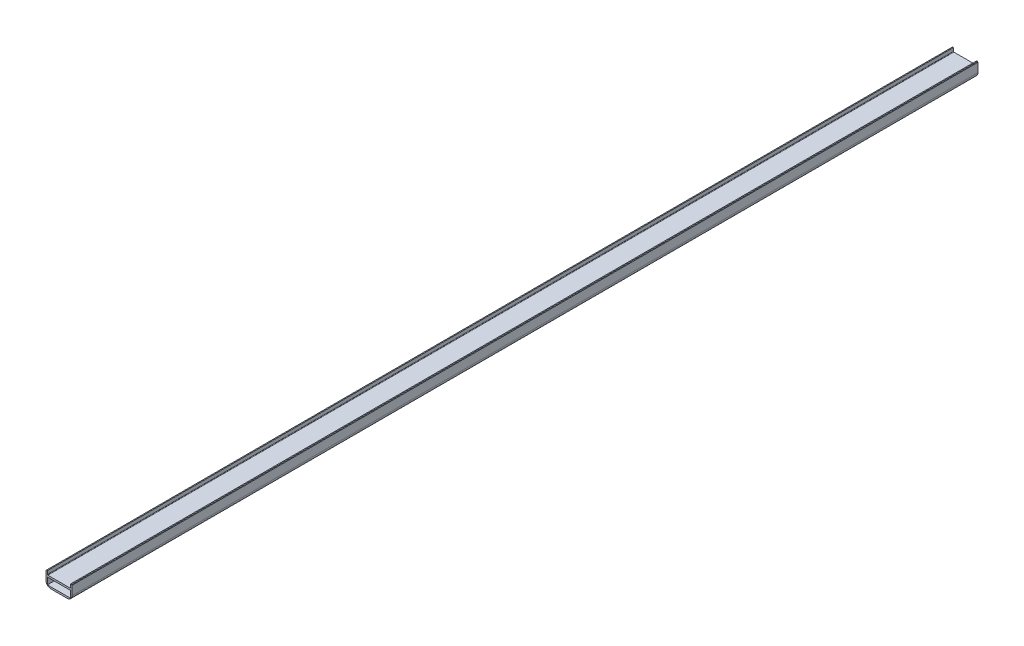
ISO-10303-21;
HEADER;
FILE_DESCRIPTION(('STEP AP214'),'2;1');
FILE_NAME('part.step','',(''),(''),'','','');
FILE_SCHEMA(('AUTOMOTIVE_DESIGN { 1 0 10303 214 1 1 1 1 }'));
ENDSEC;
DATA;
#1=APPLICATION_CONTEXT('core data for automotive mechanical design processes');
#2=APPLICATION_PROTOCOL_DEFINITION('international standard','automotive_design',2000,#1);
#3=PRODUCT_CONTEXT('',#1,'mechanical');
#4=PRODUCT('Part','Part','',(#3));
#5=PRODUCT_RELATED_PRODUCT_CATEGORY('part','',(#4));
#6=PRODUCT_DEFINITION_FORMATION('','',#4);
#7=PRODUCT_DEFINITION_CONTEXT('part definition',#1,'design');
#8=PRODUCT_DEFINITION('design','',#6,#7);
#9=PRODUCT_DEFINITION_SHAPE('','',#8);
#10=(LENGTH_UNIT() NAMED_UNIT(*) SI_UNIT(.MILLI.,.METRE.));
#11=(NAMED_UNIT(*) PLANE_ANGLE_UNIT() SI_UNIT($,.RADIAN.));
#12=(NAMED_UNIT(*) SI_UNIT($,.STERADIAN.) SOLID_ANGLE_UNIT());
#13=UNCERTAINTY_MEASURE_WITH_UNIT(LENGTH_MEASURE(1.E-05),#10,'distance_accuracy_value','');
#14=(GEOMETRIC_REPRESENTATION_CONTEXT(3) GLOBAL_UNCERTAINTY_ASSIGNED_CONTEXT((#13)) GLOBAL_UNIT_ASSIGNED_CONTEXT((#10,
#11,#12)) REPRESENTATION_CONTEXT('',''));
#15=CARTESIAN_POINT('',(0.,0.,0.));
#16=DIRECTION('',(0.,0.,1.));
#17=DIRECTION('',(1.,0.,0.));
#18=AXIS2_PLACEMENT_3D('',#15,#16,#17);
#19=CARTESIAN_POINT('',(-24.5,3.02774114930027,960.));
#20=DIRECTION('',(-1.,0.,0.));
#21=DIRECTION('',(0.,0.,1.));
#22=AXIS2_PLACEMENT_3D('',#19,#20,#21);
#23=PLANE('',#22);
#24=DIRECTION('',(0.,1.,0.));
#25=VECTOR('',#24,1.);
#26=CARTESIAN_POINT('',(-24.5,3.02774114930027,-960.));
#27=LINE('',#26,#25);
#28=CARTESIAN_POINT('',(-24.5,-3.97225885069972,-960.));
#29=VERTEX_POINT('',#28);
#30=CARTESIAN_POINT('',(-24.5,3.02774114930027,-960.));
#31=VERTEX_POINT('',#30);
#32=EDGE_CURVE('E184',#29,#31,#27,.T.);
#33=ORIENTED_EDGE('',*,*,#32,.T.);
#34=DIRECTION('',(0.,0.,-1.));
#35=VECTOR('',#34,1.);
#36=CARTESIAN_POINT('',(-24.5,3.02774114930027,960.));
#37=LINE('',#36,#35);
#38=CARTESIAN_POINT('',(-24.5,3.02774114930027,960.));
#39=VERTEX_POINT('',#38);
#40=EDGE_CURVE('E249',#39,#31,#37,.T.);
#41=ORIENTED_EDGE('',*,*,#40,.F.);
#42=DIRECTION('',(0.,1.,0.));
#43=VECTOR('',#42,1.);
#44=CARTESIAN_POINT('',(-24.5,3.02774114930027,960.));
#45=LINE('',#44,#43);
#46=CARTESIAN_POINT('',(-24.5,-3.97225885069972,960.));
#47=VERTEX_POINT('',#46);
#48=EDGE_CURVE('E187',#47,#39,#45,.T.);
#49=ORIENTED_EDGE('',*,*,#48,.F.);
#50=DIRECTION('',(0.,0.,-1.));
#51=VECTOR('',#50,1.);
#52=CARTESIAN_POINT('',(-24.5,-3.97225885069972,960.));
#53=LINE('',#52,#51);
#54=EDGE_CURVE('E212',#47,#29,#53,.T.);
#55=ORIENTED_EDGE('',*,*,#54,.T.);
#56=EDGE_LOOP('',(#33,#41,#49,#55));
#57=FACE_BOUND('',#56,.T.);
#58=ADVANCED_FACE('F34',(#57),#23,.F.);
#59=CARTESIAN_POINT('',(-24.5,3.02774114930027,960.));
#60=DIRECTION('',(0.,-1.,0.));
#61=DIRECTION('',(1.,0.,0.));
#62=AXIS2_PLACEMENT_3D('',#59,#60,#61);
#63=PLANE('',#62);
#64=DIRECTION('',(-1.,0.,0.));
#65=VECTOR('',#64,1.);
#66=CARTESIAN_POINT('',(-24.5,3.02774114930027,-960.));
#67=LINE('',#66,#65);
#68=CARTESIAN_POINT('',(-26.4999999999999,3.02774114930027,-960.));
#69=VERTEX_POINT('',#68);
#70=EDGE_CURVE('E215',#31,#69,#67,.T.);
#71=ORIENTED_EDGE('',*,*,#70,.T.);
#72=DIRECTION('',(0.,0.,1.));
#73=VECTOR('',#72,1.);
#74=CARTESIAN_POINT('',(-26.4999999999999,3.02774114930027,960.));
#75=LINE('',#74,#73);
#76=CARTESIAN_POINT('',(-26.4999999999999,3.02774114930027,960.));
#77=VERTEX_POINT('',#76);
#78=EDGE_CURVE('E288',#69,#77,#75,.T.);
#79=ORIENTED_EDGE('',*,*,#78,.T.);
#80=DIRECTION('',(-1.,0.,0.));
#81=VECTOR('',#80,1.);
#82=CARTESIAN_POINT('',(-24.5,3.02774114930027,960.));
#83=LINE('',#82,#81);
#84=EDGE_CURVE('E190',#39,#77,#83,.T.);
#85=ORIENTED_EDGE('',*,*,#84,.F.);
#86=ORIENTED_EDGE('',*,*,#40,.T.);
#87=EDGE_LOOP('',(#71,#79,#85,#86));
#88=FACE_BOUND('',#87,.T.);
#89=ADVANCED_FACE('F313',(#88),#63,.F.);
#90=CARTESIAN_POINT('',(-27.5,3.02774114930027,960.));
#91=DIRECTION('',(1.,0.,0.));
#92=DIRECTION('',(0.,1.,0.));
#93=AXIS2_PLACEMENT_3D('',#90,#91,#92);
#94=PLANE('',#93);
#95=DIRECTION('',(0.,-1.,0.));
#96=VECTOR('',#95,1.);
#97=CARTESIAN_POINT('',(-27.5,3.02774114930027,960.));
#98=LINE('',#97,#96);
#99=CARTESIAN_POINT('',(-27.5,2.02774114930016,960.));
#100=VERTEX_POINT('',#99);
#101=CARTESIAN_POINT('',(-27.5,-16.9722588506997,960.));
#102=VERTEX_POINT('',#101);
#103=EDGE_CURVE('E194',#100,#102,#98,.T.);
#104=ORIENTED_EDGE('',*,*,#103,.F.);
#105=DIRECTION('',(0.,0.,-1.));
#106=VECTOR('',#105,1.);
#107=CARTESIAN_POINT('',(-27.5,2.02774114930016,960.));
#108=LINE('',#107,#106);
#109=CARTESIAN_POINT('',(-27.5,2.02774114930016,-960.));
#110=VERTEX_POINT('',#109);
#111=EDGE_CURVE('E285',#100,#110,#108,.T.);
#112=ORIENTED_EDGE('',*,*,#111,.T.);
#113=DIRECTION('',(0.,-1.,0.));
#114=VECTOR('',#113,1.);
#115=CARTESIAN_POINT('',(-27.5,3.02774114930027,-960.));
#116=LINE('',#115,#114);
#117=CARTESIAN_POINT('',(-27.5,-16.9722588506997,-960.));
#118=VERTEX_POINT('',#117);
#119=EDGE_CURVE('E218',#110,#118,#116,.T.);
#120=ORIENTED_EDGE('',*,*,#119,.T.);
#121=DIRECTION('',(0.,0.,-1.));
#122=VECTOR('',#121,1.);
#123=CARTESIAN_POINT('',(-27.5,-16.9722588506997,960.));
#124=LINE('',#123,#122);
#125=EDGE_CURVE('E262',#118,#102,#124,.F.);
#126=ORIENTED_EDGE('',*,*,#125,.T.);
#127=EDGE_LOOP('',(#104,#112,#120,#126));
#128=FACE_BOUND('',#127,.T.);
#129=ADVANCED_FACE('F319',(#128),#94,.F.);
#130=CARTESIAN_POINT('',(27.5,-26.9722588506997,960.));
#131=DIRECTION('',(0.,1.,0.));
#132=DIRECTION('',(-1.,0.,0.));
#133=AXIS2_PLACEMENT_3D('',#130,#131,#132);
#134=PLANE('',#133);
#135=DIRECTION('',(1.,0.,0.));
#136=VECTOR('',#135,1.);
#137=CARTESIAN_POINT('',(27.5,-26.9722588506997,960.));
#138=LINE('',#137,#136);
#139=CARTESIAN_POINT('',(-17.5,-26.9722588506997,960.));
#140=VERTEX_POINT('',#139);
#141=CARTESIAN_POINT('',(17.5,-26.9722588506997,960.));
#142=VERTEX_POINT('',#141);
#143=EDGE_CURVE('E196',#140,#142,#138,.T.);
#144=ORIENTED_EDGE('',*,*,#143,.F.);
#145=DIRECTION('',(0.,0.,-1.));
#146=VECTOR('',#145,1.);
#147=CARTESIAN_POINT('',(-17.5,-26.9722588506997,960.));
#148=LINE('',#147,#146);
#149=CARTESIAN_POINT('',(-17.5,-26.9722588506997,-960.));
#150=VERTEX_POINT('',#149);
#151=EDGE_CURVE('E254',#140,#150,#148,.T.);
#152=ORIENTED_EDGE('',*,*,#151,.T.);
#153=DIRECTION('',(1.,0.,0.));
#154=VECTOR('',#153,1.);
#155=CARTESIAN_POINT('',(27.5,-26.9722588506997,-960.));
#156=LINE('',#155,#154);
#157=CARTESIAN_POINT('',(17.5,-26.9722588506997,-960.));
#158=VERTEX_POINT('',#157);
#159=EDGE_CURVE('E220',#150,#158,#156,.T.);
#160=ORIENTED_EDGE('',*,*,#159,.T.);
#161=DIRECTION('',(0.,0.,-1.));
#162=VECTOR('',#161,1.);
#163=CARTESIAN_POINT('',(17.5,-26.9722588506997,960.));
#164=LINE('',#163,#162);
#165=EDGE_CURVE('E252',#158,#142,#164,.F.);
#166=ORIENTED_EDGE('',*,*,#165,.T.);
#167=EDGE_LOOP('',(#144,#152,#160,#166));
#168=FACE_BOUND('',#167,.T.);
#169=ADVANCED_FACE('F379',(#168),#134,.F.);
#170=CARTESIAN_POINT('',(27.5,3.02774114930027,960.));
#171=DIRECTION('',(-1.,0.,0.));
#172=DIRECTION('',(0.,0.,1.));
#173=AXIS2_PLACEMENT_3D('',#170,#171,#172);
#174=PLANE('',#173);
#175=DIRECTION('',(0.,1.,0.));
#176=VECTOR('',#175,1.);
#177=CARTESIAN_POINT('',(27.5,3.02774114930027,-960.));
#178=LINE('',#177,#176);
#179=CARTESIAN_POINT('',(27.5,-16.9722588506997,-960.));
#180=VERTEX_POINT('',#179);
#181=CARTESIAN_POINT('',(27.5,2.02774114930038,-960.));
#182=VERTEX_POINT('',#181);
#183=EDGE_CURVE('E223',#180,#182,#178,.T.);
#184=ORIENTED_EDGE('',*,*,#183,.T.);
#185=DIRECTION('',(0.,0.,1.));
#186=VECTOR('',#185,1.);
#187=CARTESIAN_POINT('',(27.5,2.02774114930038,960.));
#188=LINE('',#187,#186);
#189=CARTESIAN_POINT('',(27.5,2.02774114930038,960.));
#190=VERTEX_POINT('',#189);
#191=EDGE_CURVE('E279',#182,#190,#188,.T.);
#192=ORIENTED_EDGE('',*,*,#191,.T.);
#193=DIRECTION('',(0.,1.,0.));
#194=VECTOR('',#193,1.);
#195=CARTESIAN_POINT('',(27.5,3.02774114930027,960.));
#196=LINE('',#195,#194);
#197=CARTESIAN_POINT('',(27.5,-16.9722588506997,960.));
#198=VERTEX_POINT('',#197);
#199=EDGE_CURVE('E199',#198,#190,#196,.T.);
#200=ORIENTED_EDGE('',*,*,#199,.F.);
#201=DIRECTION('',(0.,0.,-1.));
#202=VECTOR('',#201,1.);
#203=CARTESIAN_POINT('',(27.5,-16.9722588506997,960.));
#204=LINE('',#203,#202);
#205=EDGE_CURVE('E269',#198,#180,#204,.T.);
#206=ORIENTED_EDGE('',*,*,#205,.T.);
#207=EDGE_LOOP('',(#184,#192,#200,#206));
#208=FACE_BOUND('',#207,.T.);
#209=ADVANCED_FACE('F384',(#208),#174,.F.);
#210=CARTESIAN_POINT('',(24.5,3.02774114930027,960.));
#211=DIRECTION('',(0.,-1.,0.));
#212=DIRECTION('',(1.,0.,0.));
#213=AXIS2_PLACEMENT_3D('',#210,#211,#212);
#214=PLANE('',#213);
#215=DIRECTION('',(-1.,0.,0.));
#216=VECTOR('',#215,1.);
#217=CARTESIAN_POINT('',(24.5,3.02774114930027,960.));
#218=LINE('',#217,#216);
#219=CARTESIAN_POINT('',(26.5000000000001,3.02774114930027,960.));
#220=VERTEX_POINT('',#219);
#221=CARTESIAN_POINT('',(24.5,3.02774114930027,960.));
#222=VERTEX_POINT('',#221);
#223=EDGE_CURVE('E202',#220,#222,#218,.T.);
#224=ORIENTED_EDGE('',*,*,#223,.F.);
#225=DIRECTION('',(0.,0.,-1.));
#226=VECTOR('',#225,1.);
#227=CARTESIAN_POINT('',(26.5000000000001,3.02774114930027,960.));
#228=LINE('',#227,#226);
#229=CARTESIAN_POINT('',(26.5000000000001,3.02774114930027,-960.));
#230=VERTEX_POINT('',#229);
#231=EDGE_CURVE('E272',#220,#230,#228,.T.);
#232=ORIENTED_EDGE('',*,*,#231,.T.);
#233=DIRECTION('',(-1.,0.,0.));
#234=VECTOR('',#233,1.);
#235=CARTESIAN_POINT('',(24.5,3.02774114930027,-960.));
#236=LINE('',#235,#234);
#237=CARTESIAN_POINT('',(24.5,3.02774114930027,-960.));
#238=VERTEX_POINT('',#237);
#239=EDGE_CURVE('E226',#230,#238,#236,.T.);
#240=ORIENTED_EDGE('',*,*,#239,.T.);
#241=DIRECTION('',(0.,0.,-1.));
#242=VECTOR('',#241,1.);
#243=CARTESIAN_POINT('',(24.5,3.02774114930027,960.));
#244=LINE('',#243,#242);
#245=EDGE_CURVE('E246',#222,#238,#244,.T.);
#246=ORIENTED_EDGE('',*,*,#245,.F.);
#247=EDGE_LOOP('',(#224,#232,#240,#246));
#248=FACE_BOUND('',#247,.T.);
#249=ADVANCED_FACE('F342',(#248),#214,.F.);
#250=CARTESIAN_POINT('',(24.5,3.02774114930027,960.));
#251=DIRECTION('',(1.,0.,0.));
#252=DIRECTION('',(0.,0.,-1.));
#253=AXIS2_PLACEMENT_3D('',#250,#251,#252);
#254=PLANE('',#253);
#255=DIRECTION('',(0.,-1.,0.));
#256=VECTOR('',#255,1.);
#257=CARTESIAN_POINT('',(24.5,3.02774114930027,-960.));
#258=LINE('',#257,#256);
#259=CARTESIAN_POINT('',(24.5,-3.97225885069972,-960.));
#260=VERTEX_POINT('',#259);
#261=EDGE_CURVE('E228',#238,#260,#258,.T.);
#262=ORIENTED_EDGE('',*,*,#261,.T.);
#263=DIRECTION('',(0.,0.,-1.));
#264=VECTOR('',#263,1.);
#265=CARTESIAN_POINT('',(24.5,-3.97225885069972,960.));
#266=LINE('',#265,#264);
#267=CARTESIAN_POINT('',(24.5,-3.97225885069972,960.));
#268=VERTEX_POINT('',#267);
#269=EDGE_CURVE('E243',#268,#260,#266,.T.);
#270=ORIENTED_EDGE('',*,*,#269,.F.);
#271=DIRECTION('',(0.,-1.,0.));
#272=VECTOR('',#271,1.);
#273=CARTESIAN_POINT('',(24.5,3.02774114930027,960.));
#274=LINE('',#273,#272);
#275=EDGE_CURVE('E204',#222,#268,#274,.T.);
#276=ORIENTED_EDGE('',*,*,#275,.F.);
#277=ORIENTED_EDGE('',*,*,#245,.T.);
#278=EDGE_LOOP('',(#262,#270,#276,#277));
#279=FACE_BOUND('',#278,.T.);
#280=ADVANCED_FACE('F348',(#279),#254,.F.);
#281=CARTESIAN_POINT('',(23.5,-3.97225885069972,960.));
#282=DIRECTION('',(0.,0.,-1.));
#283=DIRECTION('',(-1.,0.,0.));
#284=AXIS2_PLACEMENT_3D('',#281,#282,#283);
#285=CYLINDRICAL_SURFACE('',#284,1.00000000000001);
#286=CARTESIAN_POINT('',(23.5,-3.97225885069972,-960.));
#287=DIRECTION('',(0.,0.,-1.));
#288=DIRECTION('',(1.,0.,0.));
#289=AXIS2_PLACEMENT_3D('',#286,#287,#288);
#290=CIRCLE('',#289,1.00000000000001);
#291=CARTESIAN_POINT('',(23.5,-4.97225885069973,-960.));
#292=VERTEX_POINT('',#291);
#293=EDGE_CURVE('E230',#260,#292,#290,.T.);
#294=ORIENTED_EDGE('',*,*,#293,.T.);
#295=DIRECTION('',(0.,0.,-1.));
#296=VECTOR('',#295,1.);
#297=CARTESIAN_POINT('',(23.5,-4.97225885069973,960.));
#298=LINE('',#297,#296);
#299=CARTESIAN_POINT('',(23.5,-4.97225885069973,960.));
#300=VERTEX_POINT('',#299);
#301=EDGE_CURVE('E240',#300,#292,#298,.T.);
#302=ORIENTED_EDGE('',*,*,#301,.F.);
#303=CARTESIAN_POINT('',(23.5,-3.97225885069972,960.));
#304=DIRECTION('',(0.,0.,-1.));
#305=DIRECTION('',(1.,0.,0.));
#306=AXIS2_PLACEMENT_3D('',#303,#304,#305);
#307=CIRCLE('',#306,1.00000000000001);
#308=EDGE_CURVE('E206',#268,#300,#307,.T.);
#309=ORIENTED_EDGE('',*,*,#308,.F.);
#310=ORIENTED_EDGE('',*,*,#269,.T.);
#311=EDGE_LOOP('',(#294,#302,#309,#310));
#312=FACE_BOUND('',#311,.T.);
#313=ADVANCED_FACE('F354',(#312),#285,.F.);
#314=CARTESIAN_POINT('',(-23.5,-4.97225885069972,960.));
#315=DIRECTION('',(0.,-1.,0.));
#316=DIRECTION('',(0.,0.,-1.));
#317=AXIS2_PLACEMENT_3D('',#314,#315,#316);
#318=PLANE('',#317);
#319=DIRECTION('',(-1.,0.,0.));
#320=VECTOR('',#319,1.);
#321=CARTESIAN_POINT('',(-23.5,-4.97225885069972,-960.));
#322=LINE('',#321,#320);
#323=CARTESIAN_POINT('',(-23.5,-4.97225885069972,-960.));
#324=VERTEX_POINT('',#323);
#325=EDGE_CURVE('E232',#292,#324,#322,.T.);
#326=ORIENTED_EDGE('',*,*,#325,.T.);
#327=DIRECTION('',(0.,0.,-1.));
#328=VECTOR('',#327,1.);
#329=CARTESIAN_POINT('',(-23.5,-4.97225885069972,960.));
#330=LINE('',#329,#328);
#331=CARTESIAN_POINT('',(-23.5,-4.97225885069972,960.));
#332=VERTEX_POINT('',#331);
#333=EDGE_CURVE('E237',#332,#324,#330,.T.);
#334=ORIENTED_EDGE('',*,*,#333,.F.);
#335=DIRECTION('',(-1.,0.,0.));
#336=VECTOR('',#335,1.);
#337=CARTESIAN_POINT('',(-23.5,-4.97225885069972,960.));
#338=LINE('',#337,#336);
#339=EDGE_CURVE('E208',#300,#332,#338,.T.);
#340=ORIENTED_EDGE('',*,*,#339,.F.);
#341=ORIENTED_EDGE('',*,*,#301,.T.);
#342=EDGE_LOOP('',(#326,#334,#340,#341));
#343=FACE_BOUND('',#342,.T.);
#344=ADVANCED_FACE('F358',(#343),#318,.F.);
#345=CARTESIAN_POINT('',(-23.5,-3.97225885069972,960.));
#346=DIRECTION('',(0.,0.,-1.));
#347=DIRECTION('',(-1.,0.,0.));
#348=AXIS2_PLACEMENT_3D('',#345,#346,#347);
#349=CYLINDRICAL_SURFACE('',#348,1.00000000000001);
#350=CARTESIAN_POINT('',(-23.5,-3.97225885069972,-960.));
#351=DIRECTION('',(0.,0.,-1.));
#352=DIRECTION('',(-1.,0.,0.));
#353=AXIS2_PLACEMENT_3D('',#350,#351,#352);
#354=CIRCLE('',#353,1.00000000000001);
#355=EDGE_CURVE('E191',#324,#29,#354,.T.);
#356=ORIENTED_EDGE('',*,*,#355,.T.);
#357=ORIENTED_EDGE('',*,*,#54,.F.);
#358=CARTESIAN_POINT('',(-23.5,-3.97225885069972,960.));
#359=DIRECTION('',(0.,0.,-1.));
#360=DIRECTION('',(-1.,0.,0.));
#361=AXIS2_PLACEMENT_3D('',#358,#359,#360);
#362=CIRCLE('',#361,1.00000000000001);
#363=EDGE_CURVE('E210',#332,#47,#362,.T.);
#364=ORIENTED_EDGE('',*,*,#363,.F.);
#365=ORIENTED_EDGE('',*,*,#333,.T.);
#366=EDGE_LOOP('',(#356,#357,#364,#365));
#367=FACE_BOUND('',#366,.T.);
#368=ADVANCED_FACE('F363',(#367),#349,.F.);
#369=CARTESIAN_POINT('',(-23.5,-3.97225885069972,960.));
#370=DIRECTION('',(0.,0.,-1.));
#371=DIRECTION('',(-1.,0.,0.));
#372=AXIS2_PLACEMENT_3D('',#369,#370,#371);
#373=PLANE('',#372);
#374=DIRECTION('',(-1.,0.,0.));
#375=VECTOR('',#374,1.);
#376=CARTESIAN_POINT('',(-24.5,-8.77807914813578,960.));
#377=LINE('',#376,#375);
#378=CARTESIAN_POINT('',(24.5,-8.77807914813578,960.));
#379=VERTEX_POINT('',#378);
#380=CARTESIAN_POINT('',(-24.5,-8.77807914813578,960.));
#381=VERTEX_POINT('',#380);
#382=EDGE_CURVE('E170',#379,#381,#377,.T.);
#383=ORIENTED_EDGE('',*,*,#382,.F.);
#384=DIRECTION('',(0.,1.,0.));
#385=VECTOR('',#384,1.);
#386=CARTESIAN_POINT('',(24.5,-8.77807914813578,960.));
#387=LINE('',#386,#385);
#388=CARTESIAN_POINT('',(24.5,-23.1664385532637,960.));
#389=VERTEX_POINT('',#388);
#390=EDGE_CURVE('E49',#389,#379,#387,.T.);
#391=ORIENTED_EDGE('',*,*,#390,.F.);
#392=DIRECTION('',(1.,0.,0.));
#393=VECTOR('',#392,1.);
#394=CARTESIAN_POINT('',(-24.5,-23.1664385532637,960.));
#395=LINE('',#394,#393);
#396=CARTESIAN_POINT('',(-24.5,-23.1664385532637,960.));
#397=VERTEX_POINT('',#396);
#398=EDGE_CURVE('E177',#397,#389,#395,.T.);
#399=ORIENTED_EDGE('',*,*,#398,.F.);
#400=DIRECTION('',(0.,-1.,0.));
#401=VECTOR('',#400,1.);
#402=CARTESIAN_POINT('',(-24.5,-8.77807914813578,960.));
#403=LINE('',#402,#401);
#404=EDGE_CURVE('E161',#381,#397,#403,.T.);
#405=ORIENTED_EDGE('',*,*,#404,.F.);
#406=EDGE_LOOP('',(#383,#391,#399,#405));
#407=FACE_BOUND('',#406,.T.);
#408=ORIENTED_EDGE('',*,*,#199,.T.);
#409=DIRECTION('',(0.707106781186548,-0.707106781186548,0.));
#410=VECTOR('',#409,1.);
#411=CARTESIAN_POINT('',(26.5000000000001,3.02774114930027,960.));
#412=LINE('',#411,#410);
#413=EDGE_CURVE('E283',#190,#220,#412,.F.);
#414=ORIENTED_EDGE('',*,*,#413,.T.);
#415=ORIENTED_EDGE('',*,*,#223,.T.);
#416=ORIENTED_EDGE('',*,*,#275,.T.);
#417=ORIENTED_EDGE('',*,*,#308,.T.);
#418=ORIENTED_EDGE('',*,*,#339,.T.);
#419=ORIENTED_EDGE('',*,*,#363,.T.);
#420=ORIENTED_EDGE('',*,*,#48,.T.);
#421=ORIENTED_EDGE('',*,*,#84,.T.);
#422=DIRECTION('',(0.707106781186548,0.707106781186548,0.));
#423=VECTOR('',#422,1.);
#424=CARTESIAN_POINT('',(-27.5,2.02774114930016,960.));
#425=LINE('',#424,#423);
#426=EDGE_CURVE('E281',#77,#100,#425,.F.);
#427=ORIENTED_EDGE('',*,*,#426,.T.);
#428=ORIENTED_EDGE('',*,*,#103,.T.);
#429=CARTESIAN_POINT('',(-17.5,-16.9722588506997,960.));
#430=DIRECTION('',(0.,0.,-1.));
#431=DIRECTION('',(-1.,0.,0.));
#432=AXIS2_PLACEMENT_3D('',#429,#430,#431);
#433=CIRCLE('',#432,10.);
#434=EDGE_CURVE('E267',#102,#140,#433,.F.);
#435=ORIENTED_EDGE('',*,*,#434,.T.);
#436=ORIENTED_EDGE('',*,*,#143,.T.);
#437=CARTESIAN_POINT('',(17.5,-16.9722588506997,960.));
#438=DIRECTION('',(0.,0.,-1.));
#439=DIRECTION('',(-1.,0.,0.));
#440=AXIS2_PLACEMENT_3D('',#437,#438,#439);
#441=CIRCLE('',#440,10.);
#442=EDGE_CURVE('E265',#142,#198,#441,.F.);
#443=ORIENTED_EDGE('',*,*,#442,.T.);
#444=EDGE_LOOP('',(#408,#414,#415,#416,#417,#418,#419,#420,#421,#427,#428,#435,#436,#443));
#445=FACE_BOUND('',#444,.T.);
#446=ADVANCED_FACE('F174',(#407,#445),#373,.F.);
#447=CARTESIAN_POINT('',(-23.5,-3.97225885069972,-960.));
#448=DIRECTION('',(0.,0.,-1.));
#449=DIRECTION('',(-1.,0.,0.));
#450=AXIS2_PLACEMENT_3D('',#447,#448,#449);
#451=PLANE('',#450);
#452=DIRECTION('',(0.,-1.,0.));
#453=VECTOR('',#452,1.);
#454=CARTESIAN_POINT('',(24.5,-3.97225885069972,-960.));
#455=LINE('',#454,#453);
#456=CARTESIAN_POINT('',(24.5,-8.77807914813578,-960.));
#457=VERTEX_POINT('',#456);
#458=CARTESIAN_POINT('',(24.5,-23.1664385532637,-960.));
#459=VERTEX_POINT('',#458);
#460=EDGE_CURVE('E11',#457,#459,#455,.T.);
#461=ORIENTED_EDGE('',*,*,#460,.F.);
#462=DIRECTION('',(1.,0.,0.));
#463=VECTOR('',#462,1.);
#464=CARTESIAN_POINT('',(-23.5,-8.77807914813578,-960.));
#465=LINE('',#464,#463);
#466=CARTESIAN_POINT('',(-24.5,-8.77807914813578,-960.));
#467=VERTEX_POINT('',#466);
#468=EDGE_CURVE('E290',#467,#457,#465,.T.);
#469=ORIENTED_EDGE('',*,*,#468,.F.);
#470=DIRECTION('',(0.,1.,0.));
#471=VECTOR('',#470,1.);
#472=CARTESIAN_POINT('',(-24.5,-3.97225885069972,-960.));
#473=LINE('',#472,#471);
#474=CARTESIAN_POINT('',(-24.5,-23.1664385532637,-960.));
#475=VERTEX_POINT('',#474);
#476=EDGE_CURVE('E164',#475,#467,#473,.T.);
#477=ORIENTED_EDGE('',*,*,#476,.F.);
#478=DIRECTION('',(-1.,0.,0.));
#479=VECTOR('',#478,1.);
#480=CARTESIAN_POINT('',(-23.5,-23.1664385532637,-960.));
#481=LINE('',#480,#479);
#482=EDGE_CURVE('E42',#459,#475,#481,.T.);
#483=ORIENTED_EDGE('',*,*,#482,.F.);
#484=EDGE_LOOP('',(#461,#469,#477,#483));
#485=FACE_BOUND('',#484,.T.);
#486=ORIENTED_EDGE('',*,*,#239,.F.);
#487=DIRECTION('',(-0.707106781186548,0.707106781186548,0.));
#488=VECTOR('',#487,1.);
#489=CARTESIAN_POINT('',(5.00000000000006,24.5277411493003,-960.));
#490=LINE('',#489,#488);
#491=EDGE_CURVE('E277',#230,#182,#490,.F.);
#492=ORIENTED_EDGE('',*,*,#491,.T.);
#493=ORIENTED_EDGE('',*,*,#183,.F.);
#494=CARTESIAN_POINT('',(17.5,-16.9722588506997,-960.));
#495=DIRECTION('',(0.,0.,-1.));
#496=DIRECTION('',(-1.,0.,0.));
#497=AXIS2_PLACEMENT_3D('',#494,#495,#496);
#498=CIRCLE('',#497,10.);
#499=EDGE_CURVE('E257',#180,#158,#498,.T.);
#500=ORIENTED_EDGE('',*,*,#499,.T.);
#501=ORIENTED_EDGE('',*,*,#159,.F.);
#502=CARTESIAN_POINT('',(-17.5,-16.9722588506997,-960.));
#503=DIRECTION('',(0.,0.,-1.));
#504=DIRECTION('',(-1.,0.,0.));
#505=AXIS2_PLACEMENT_3D('',#502,#503,#504);
#506=CIRCLE('',#505,10.);
#507=EDGE_CURVE('E259',#150,#118,#506,.T.);
#508=ORIENTED_EDGE('',*,*,#507,.T.);
#509=ORIENTED_EDGE('',*,*,#119,.F.);
#510=DIRECTION('',(-0.707106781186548,-0.707106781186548,0.));
#511=VECTOR('',#510,1.);
#512=CARTESIAN_POINT('',(-28.4999999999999,1.02774114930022,-960.));
#513=LINE('',#512,#511);
#514=EDGE_CURVE('E275',#110,#69,#513,.F.);
#515=ORIENTED_EDGE('',*,*,#514,.T.);
#516=ORIENTED_EDGE('',*,*,#70,.F.);
#517=ORIENTED_EDGE('',*,*,#32,.F.);
#518=ORIENTED_EDGE('',*,*,#355,.F.);
#519=ORIENTED_EDGE('',*,*,#325,.F.);
#520=ORIENTED_EDGE('',*,*,#293,.F.);
#521=ORIENTED_EDGE('',*,*,#261,.F.);
#522=EDGE_LOOP('',(#486,#492,#493,#500,#501,#508,#509,#515,#516,#517,#518,#519,#520,#521));
#523=FACE_BOUND('',#522,.T.);
#524=ADVANCED_FACE('F298',(#485,#523),#451,.T.);
#525=CARTESIAN_POINT('',(-17.5,-16.9722588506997,960.));
#526=DIRECTION('',(0.,0.,-1.));
#527=DIRECTION('',(-1.,0.,0.));
#528=AXIS2_PLACEMENT_3D('',#525,#526,#527);
#529=CYLINDRICAL_SURFACE('',#528,10.);
#530=ORIENTED_EDGE('',*,*,#434,.F.);
#531=ORIENTED_EDGE('',*,*,#125,.F.);
#532=ORIENTED_EDGE('',*,*,#507,.F.);
#533=ORIENTED_EDGE('',*,*,#151,.F.);
#534=EDGE_LOOP('',(#530,#531,#532,#533));
#535=FACE_BOUND('',#534,.T.);
#536=ADVANCED_FACE('F324',(#535),#529,.T.);
#537=CARTESIAN_POINT('',(17.5,-16.9722588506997,960.));
#538=DIRECTION('',(0.,0.,-1.));
#539=DIRECTION('',(-1.,0.,0.));
#540=AXIS2_PLACEMENT_3D('',#537,#538,#539);
#541=CYLINDRICAL_SURFACE('',#540,10.);
#542=ORIENTED_EDGE('',*,*,#442,.F.);
#543=ORIENTED_EDGE('',*,*,#165,.F.);
#544=ORIENTED_EDGE('',*,*,#499,.F.);
#545=ORIENTED_EDGE('',*,*,#205,.F.);
#546=EDGE_LOOP('',(#542,#543,#544,#545));
#547=FACE_BOUND('',#546,.T.);
#548=ADVANCED_FACE('F327',(#547),#541,.T.);
#549=CARTESIAN_POINT('',(26.5000000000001,3.02774114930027,960.));
#550=DIRECTION('',(-0.707106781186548,-0.707106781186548,0.));
#551=DIRECTION('',(0.,0.,-1.));
#552=AXIS2_PLACEMENT_3D('',#549,#550,#551);
#553=PLANE('',#552);
#554=ORIENTED_EDGE('',*,*,#413,.F.);
#555=ORIENTED_EDGE('',*,*,#191,.F.);
#556=ORIENTED_EDGE('',*,*,#491,.F.);
#557=ORIENTED_EDGE('',*,*,#231,.F.);
#558=EDGE_LOOP('',(#554,#555,#556,#557));
#559=FACE_BOUND('',#558,.T.);
#560=ADVANCED_FACE('F308',(#559),#553,.F.);
#561=CARTESIAN_POINT('',(-27.5,2.02774114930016,960.));
#562=DIRECTION('',(0.707106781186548,-0.707106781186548,0.));
#563=DIRECTION('',(0.,0.,-1.));
#564=AXIS2_PLACEMENT_3D('',#561,#562,#563);
#565=PLANE('',#564);
#566=ORIENTED_EDGE('',*,*,#426,.F.);
#567=ORIENTED_EDGE('',*,*,#78,.F.);
#568=ORIENTED_EDGE('',*,*,#514,.F.);
#569=ORIENTED_EDGE('',*,*,#111,.F.);
#570=EDGE_LOOP('',(#566,#567,#568,#569));
#571=FACE_BOUND('',#570,.T.);
#572=ADVANCED_FACE('F36',(#571),#565,.F.);
#573=CARTESIAN_POINT('',(24.5,-8.77807914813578,-1047.));
#574=DIRECTION('',(1.,0.,0.));
#575=DIRECTION('',(0.,0.,-1.));
#576=AXIS2_PLACEMENT_3D('',#573,#574,#575);
#577=PLANE('',#576);
#578=ORIENTED_EDGE('',*,*,#460,.T.);
#579=DIRECTION('',(0.,0.,1.));
#580=VECTOR('',#579,1.);
#581=CARTESIAN_POINT('',(24.5,-23.1664385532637,-1047.));
#582=LINE('',#581,#580);
#583=EDGE_CURVE('E182',#459,#389,#582,.T.);
#584=ORIENTED_EDGE('',*,*,#583,.T.);
#585=ORIENTED_EDGE('',*,*,#390,.T.);
#586=DIRECTION('',(0.,0.,1.));
#587=VECTOR('',#586,1.);
#588=CARTESIAN_POINT('',(24.5,-8.77807914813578,-1047.));
#589=LINE('',#588,#587);
#590=EDGE_CURVE('E167',#457,#379,#589,.T.);
#591=ORIENTED_EDGE('',*,*,#590,.F.);
#592=EDGE_LOOP('',(#578,#584,#585,#591));
#593=FACE_BOUND('',#592,.T.);
#594=ADVANCED_FACE('F300',(#593),#577,.F.);
#595=CARTESIAN_POINT('',(-24.5,-23.1664385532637,-1047.));
#596=DIRECTION('',(0.,-1.,0.));
#597=DIRECTION('',(0.,0.,-1.));
#598=AXIS2_PLACEMENT_3D('',#595,#596,#597);
#599=PLANE('',#598);
#600=ORIENTED_EDGE('',*,*,#482,.T.);
#601=DIRECTION('',(0.,0.,1.));
#602=VECTOR('',#601,1.);
#603=CARTESIAN_POINT('',(-24.5,-23.1664385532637,-1047.));
#604=LINE('',#603,#602);
#605=EDGE_CURVE('E166',#475,#397,#604,.T.);
#606=ORIENTED_EDGE('',*,*,#605,.T.);
#607=ORIENTED_EDGE('',*,*,#398,.T.);
#608=ORIENTED_EDGE('',*,*,#583,.F.);
#609=EDGE_LOOP('',(#600,#606,#607,#608));
#610=FACE_BOUND('',#609,.T.);
#611=ADVANCED_FACE('F295',(#610),#599,.F.);
#612=CARTESIAN_POINT('',(-24.5,-8.77807914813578,-1047.));
#613=DIRECTION('',(-1.,0.,0.));
#614=DIRECTION('',(0.,0.,1.));
#615=AXIS2_PLACEMENT_3D('',#612,#613,#614);
#616=PLANE('',#615);
#617=ORIENTED_EDGE('',*,*,#476,.T.);
#618=DIRECTION('',(0.,0.,1.));
#619=VECTOR('',#618,1.);
#620=CARTESIAN_POINT('',(-24.5,-8.77807914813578,-1047.));
#621=LINE('',#620,#619);
#622=EDGE_CURVE('E57',#467,#381,#621,.T.);
#623=ORIENTED_EDGE('',*,*,#622,.T.);
#624=ORIENTED_EDGE('',*,*,#404,.T.);
#625=ORIENTED_EDGE('',*,*,#605,.F.);
#626=EDGE_LOOP('',(#617,#623,#624,#625));
#627=FACE_BOUND('',#626,.T.);
#628=ADVANCED_FACE('F158',(#627),#616,.F.);
#629=CARTESIAN_POINT('',(-24.5,-8.77807914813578,-1047.));
#630=DIRECTION('',(0.,1.,0.));
#631=DIRECTION('',(0.,0.,1.));
#632=AXIS2_PLACEMENT_3D('',#629,#630,#631);
#633=PLANE('',#632);
#634=ORIENTED_EDGE('',*,*,#468,.T.);
#635=ORIENTED_EDGE('',*,*,#590,.T.);
#636=ORIENTED_EDGE('',*,*,#382,.T.);
#637=ORIENTED_EDGE('',*,*,#622,.F.);
#638=EDGE_LOOP('',(#634,#635,#636,#637));
#639=FACE_BOUND('',#638,.T.);
#640=ADVANCED_FACE('F171',(#639),#633,.F.);
#641=CLOSED_SHELL('',(#58,#89,#129,#169,#209,#249,#280,#313,#344,#368,#446,#524,#536,#548,#560,
#572,#594,#611,#628,#640));
#642=MANIFOLD_SOLID_BREP('B2',#641);
#643=ADVANCED_BREP_SHAPE_REPRESENTATION('',(#18,#642),#14);
#644=SHAPE_DEFINITION_REPRESENTATION(#9,#643);
ENDSEC;
END-ISO-10303-21;
